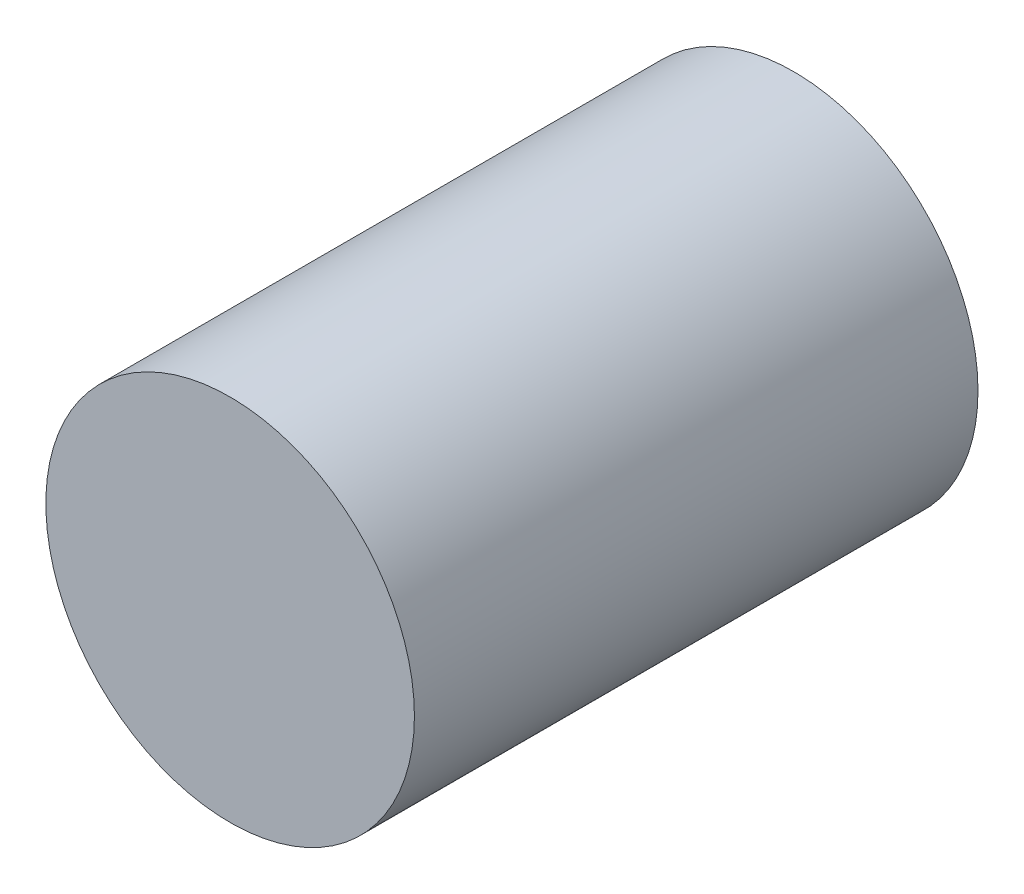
from build123d import *

# Parameters (mm, degrees)
ESQUISSE1_R          = 5
BASE_EXTRUSION_DEPTH = 15.29


with BuildPart() as part:
    # Esquisse1 → Base-Extrusion (new body)
    with BuildSketch(Plane.XY):
        with Locations((-50, 50)):
            Circle(ESQUISSE1_R)
    extrude(amount=BASE_EXTRUSION_DEPTH)


solid = part.part
